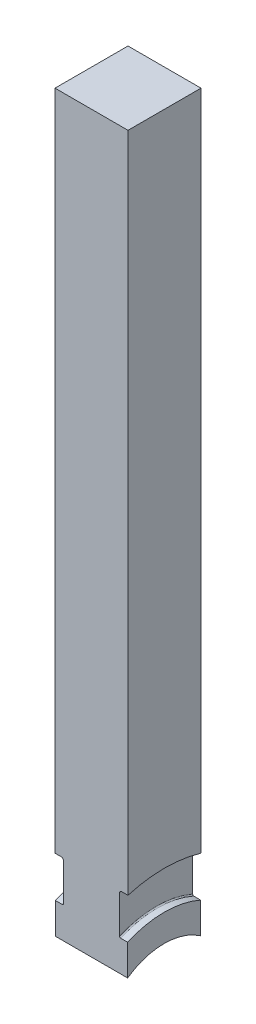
ISO-10303-21;
HEADER;
FILE_DESCRIPTION(('STEP AP214'),'2;1');
FILE_NAME('part.step','',(''),(''),'','','');
FILE_SCHEMA(('AUTOMOTIVE_DESIGN { 1 0 10303 214 1 1 1 1 }'));
ENDSEC;
DATA;
#1=APPLICATION_CONTEXT('core data for automotive mechanical design processes');
#2=APPLICATION_PROTOCOL_DEFINITION('international standard','automotive_design',2000,#1);
#3=PRODUCT_CONTEXT('',#1,'mechanical');
#4=PRODUCT('Part','Part','',(#3));
#5=PRODUCT_RELATED_PRODUCT_CATEGORY('part','',(#4));
#6=PRODUCT_DEFINITION_FORMATION('','',#4);
#7=PRODUCT_DEFINITION_CONTEXT('part definition',#1,'design');
#8=PRODUCT_DEFINITION('design','',#6,#7);
#9=PRODUCT_DEFINITION_SHAPE('','',#8);
#10=(LENGTH_UNIT() NAMED_UNIT(*) SI_UNIT(.MILLI.,.METRE.));
#11=(NAMED_UNIT(*) PLANE_ANGLE_UNIT() SI_UNIT($,.RADIAN.));
#12=(NAMED_UNIT(*) SI_UNIT($,.STERADIAN.) SOLID_ANGLE_UNIT());
#13=UNCERTAINTY_MEASURE_WITH_UNIT(LENGTH_MEASURE(1.E-05),#10,'distance_accuracy_value','');
#14=(GEOMETRIC_REPRESENTATION_CONTEXT(3) GLOBAL_UNCERTAINTY_ASSIGNED_CONTEXT((#13)) GLOBAL_UNIT_ASSIGNED_CONTEXT((#10,
#11,#12)) REPRESENTATION_CONTEXT('',''));
#15=CARTESIAN_POINT('',(0.,0.,0.));
#16=DIRECTION('',(0.,0.,1.));
#17=DIRECTION('',(1.,0.,0.));
#18=AXIS2_PLACEMENT_3D('',#15,#16,#17);
#19=CARTESIAN_POINT('',(12.827,276.225,12.827));
#20=DIRECTION('',(0.,0.,-1.));
#21=DIRECTION('',(0.,1.,0.));
#22=AXIS2_PLACEMENT_3D('',#19,#20,#21);
#23=PLANE('',#22);
#24=DIRECTION('',(-1.,0.,0.));
#25=VECTOR('',#24,1.);
#26=CARTESIAN_POINT('',(-8.84822894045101,29.043597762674,12.827));
#27=LINE('',#26,#25);
#28=CARTESIAN_POINT('',(-12.7,29.043597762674,12.827));
#29=VERTEX_POINT('',#28);
#30=CARTESIAN_POINT('',(-10.2362,29.043597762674,12.827));
#31=VERTEX_POINT('',#30);
#32=EDGE_CURVE('E196',#29,#31,#27,.F.);
#33=ORIENTED_EDGE('',*,*,#32,.F.);
#34=DIRECTION('',(0.,1.,0.));
#35=VECTOR('',#34,1.);
#36=CARTESIAN_POINT('',(-12.7,31.75,12.827));
#37=LINE('',#36,#35);
#38=CARTESIAN_POINT('',(-12.7,18.1498952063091,12.827));
#39=VERTEX_POINT('',#38);
#40=EDGE_CURVE('E178',#39,#29,#37,.T.);
#41=ORIENTED_EDGE('',*,*,#40,.F.);
#42=DIRECTION('',(1.,0.,0.));
#43=VECTOR('',#42,1.);
#44=CARTESIAN_POINT('',(-12.827,18.1498952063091,12.827));
#45=LINE('',#44,#43);
#46=CARTESIAN_POINT('',(12.7,18.1498952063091,12.827));
#47=VERTEX_POINT('',#46);
#48=EDGE_CURVE('E176',#39,#47,#45,.T.);
#49=ORIENTED_EDGE('',*,*,#48,.T.);
#50=DIRECTION('',(0.,-1.,0.));
#51=VECTOR('',#50,1.);
#52=CARTESIAN_POINT('',(12.7,31.75,12.827));
#53=LINE('',#52,#51);
#54=CARTESIAN_POINT('',(12.7,29.043597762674,12.827));
#55=VERTEX_POINT('',#54);
#56=EDGE_CURVE('E165',#55,#47,#53,.T.);
#57=ORIENTED_EDGE('',*,*,#56,.F.);
#58=DIRECTION('',(-1.,0.,0.));
#59=VECTOR('',#58,1.);
#60=CARTESIAN_POINT('',(-8.84822894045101,29.043597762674,12.827));
#61=LINE('',#60,#59);
#62=CARTESIAN_POINT('',(10.2362,29.043597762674,12.827));
#63=VERTEX_POINT('',#62);
#64=EDGE_CURVE('E152',#63,#55,#61,.F.);
#65=ORIENTED_EDGE('',*,*,#64,.F.);
#66=CARTESIAN_POINT('',(10.2362,29.043597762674,12.827));
#67=CARTESIAN_POINT('',(10.2160708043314,29.0435722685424,12.827));
#68=CARTESIAN_POINT('',(10.1959577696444,29.0453398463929,12.827));
#69=CARTESIAN_POINT('',(10.1563845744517,29.0522597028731,12.827));
#70=CARTESIAN_POINT('',(10.1369225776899,29.057401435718,12.827));
#71=CARTESIAN_POINT('',(10.0991468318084,29.0708679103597,12.827));
#72=CARTESIAN_POINT('',(10.0808326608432,29.0791914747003,12.827));
#73=CARTESIAN_POINT('',(10.0457902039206,29.0986936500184,12.827));
#74=CARTESIAN_POINT('',(10.0290627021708,29.1098736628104,12.827));
#75=CARTESIAN_POINT('',(9.99700861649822,29.1351379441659,12.827));
#76=CARTESIAN_POINT('',(9.98175149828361,29.1493101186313,12.827));
#77=CARTESIAN_POINT('',(9.95361671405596,29.1798419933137,12.827));
#78=CARTESIAN_POINT('',(9.9407396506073,29.1962022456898,12.827));
#79=CARTESIAN_POINT('',(9.91662869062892,29.2320467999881,12.827));
#80=CARTESIAN_POINT('',(9.90561137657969,29.2516766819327,12.827));
#81=CARTESIAN_POINT('',(9.8867485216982,29.2924113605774,12.827));
#82=CARTESIAN_POINT('',(9.87890468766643,29.3135169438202,12.827));
#83=CARTESIAN_POINT('',(9.86687995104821,29.3553145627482,12.827));
#84=CARTESIAN_POINT('',(9.86250087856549,29.375950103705,12.827));
#85=CARTESIAN_POINT('',(9.85666099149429,29.417597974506,12.827));
#86=CARTESIAN_POINT('',(9.85519567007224,29.4386096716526,12.827));
#87=CARTESIAN_POINT('',(9.8552,29.4596203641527,12.827));
#88=B_SPLINE_CURVE_WITH_KNOTS('',3,(#66,#67,#68,#69,#70,#71,#72,#73,#74,#75,#76,#77,#78,#79,#80,
#81,#82,#83,#84,#85,#86,#87),.UNSPECIFIED.,.F.,.F.,(4,2,2,2,2,2,2,2,2,2,4),(0.,
0.0602849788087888,0.120382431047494,0.180457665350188,0.240562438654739,0.302769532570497,
0.364992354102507,0.432238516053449,0.499520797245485,0.562601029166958,0.625583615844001),.UNSPECIFIED.);
#89=CARTESIAN_POINT('',(9.8552,29.4596203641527,12.827));
#90=VERTEX_POINT('',#89);
#91=EDGE_CURVE('E11',#63,#90,#88,.T.);
#92=ORIENTED_EDGE('',*,*,#91,.T.);
#93=DIRECTION('',(0.,-1.,0.));
#94=VECTOR('',#93,1.);
#95=CARTESIAN_POINT('',(9.8552,276.225,12.827));
#96=LINE('',#95,#94);
#97=CARTESIAN_POINT('',(9.8552,42.5855524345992,12.827));
#98=VERTEX_POINT('',#97);
#99=EDGE_CURVE('E211',#98,#90,#96,.T.);
#100=ORIENTED_EDGE('',*,*,#99,.F.);
#101=CARTESIAN_POINT('',(9.8552,42.5855524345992,12.827));
#102=CARTESIAN_POINT('',(9.85517024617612,42.6317662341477,12.827));
#103=CARTESIAN_POINT('',(9.85905310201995,42.6779817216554,12.827));
#104=CARTESIAN_POINT('',(9.87444611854,42.7691513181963,12.827));
#105=CARTESIAN_POINT('',(9.88596063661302,42.8141046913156,12.827));
#106=CARTESIAN_POINT('',(9.91643311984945,42.9014710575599,12.827));
#107=CARTESIAN_POINT('',(9.93539815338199,42.9438815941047,12.827));
#108=CARTESIAN_POINT('',(9.98032447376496,43.0247993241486,12.827));
#109=CARTESIAN_POINT('',(10.0062818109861,43.0633087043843,12.827));
#110=CARTESIAN_POINT('',(10.0639112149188,43.1343937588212,12.827));
#111=CARTESIAN_POINT('',(10.0954452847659,43.1670811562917,12.827));
#112=CARTESIAN_POINT('',(10.1637735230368,43.226428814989,12.827));
#113=CARTESIAN_POINT('',(10.200568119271,43.2530885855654,12.827));
#114=CARTESIAN_POINT('',(10.2767372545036,43.2984392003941,12.827));
#115=CARTESIAN_POINT('',(10.3159443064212,43.3174118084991,12.827));
#116=CARTESIAN_POINT('',(10.3970519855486,43.348201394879,12.827));
#117=CARTESIAN_POINT('',(10.438949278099,43.3600270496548,12.827));
#118=CARTESIAN_POINT('',(10.5038932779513,43.3722863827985,12.827));
#119=CARTESIAN_POINT('',(10.526453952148,43.3754629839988,12.827));
#120=CARTESIAN_POINT('',(10.571739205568,43.3796991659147,12.827));
#121=CARTESIAN_POINT('',(10.594463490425,43.3807618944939,12.827));
#122=CARTESIAN_POINT('',(10.6171999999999,43.3807610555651,12.827));
#123=B_SPLINE_CURVE_WITH_KNOTS('',3,(#101,#102,#103,#104,#105,#106,#107,#108,#109,#110,#111,
#112,#113,#114,#115,#116,#117,#118,#119,#120,#121,#122),.UNSPECIFIED.,.F.,.F.,(4,2,2,2,2,2,2,2,
2,2,4),(0.,0.138483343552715,0.277045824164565,0.415740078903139,0.554356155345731,
0.689928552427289,0.825511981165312,0.955539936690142,1.08540971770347,1.15367212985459,
1.22183281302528),.UNSPECIFIED.);
#124=CARTESIAN_POINT('',(10.6172,43.3807610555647,12.827));
#125=VERTEX_POINT('',#124);
#126=EDGE_CURVE('E295',#98,#125,#123,.T.);
#127=ORIENTED_EDGE('',*,*,#126,.T.);
#128=DIRECTION('',(-1.,0.,0.));
#129=VECTOR('',#128,1.);
#130=CARTESIAN_POINT('',(-8.84822894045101,43.3807610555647,12.827));
#131=LINE('',#130,#129);
#132=CARTESIAN_POINT('',(12.827,43.3807610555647,12.827));
#133=VERTEX_POINT('',#132);
#134=EDGE_CURVE('E206',#133,#125,#131,.T.);
#135=ORIENTED_EDGE('',*,*,#134,.F.);
#136=DIRECTION('',(0.,-1.,0.));
#137=VECTOR('',#136,1.);
#138=CARTESIAN_POINT('',(12.827,276.225,12.827));
#139=LINE('',#138,#137);
#140=CARTESIAN_POINT('',(12.827,276.225,12.827));
#141=VERTEX_POINT('',#140);
#142=EDGE_CURVE('E222',#141,#133,#139,.T.);
#143=ORIENTED_EDGE('',*,*,#142,.F.);
#144=DIRECTION('',(-1.,0.,0.));
#145=VECTOR('',#144,1.);
#146=CARTESIAN_POINT('',(12.827,276.225,12.827));
#147=LINE('',#146,#145);
#148=CARTESIAN_POINT('',(-12.827,276.225,12.827));
#149=VERTEX_POINT('',#148);
#150=EDGE_CURVE('E237',#141,#149,#147,.T.);
#151=ORIENTED_EDGE('',*,*,#150,.T.);
#152=DIRECTION('',(0.,-1.,0.));
#153=VECTOR('',#152,1.);
#154=CARTESIAN_POINT('',(-12.827,276.225,12.827));
#155=LINE('',#154,#153);
#156=CARTESIAN_POINT('',(-12.827,43.3807610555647,12.827));
#157=VERTEX_POINT('',#156);
#158=EDGE_CURVE('E231',#149,#157,#155,.T.);
#159=ORIENTED_EDGE('',*,*,#158,.T.);
#160=DIRECTION('',(-1.,0.,0.));
#161=VECTOR('',#160,1.);
#162=CARTESIAN_POINT('',(-8.84822894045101,43.3807610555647,12.827));
#163=LINE('',#162,#161);
#164=CARTESIAN_POINT('',(-10.6172,43.3807610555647,12.827));
#165=VERTEX_POINT('',#164);
#166=EDGE_CURVE('E202',#165,#157,#163,.T.);
#167=ORIENTED_EDGE('',*,*,#166,.F.);
#168=CARTESIAN_POINT('',(-10.6172,43.3807610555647,12.827));
#169=CARTESIAN_POINT('',(-10.5756065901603,43.3808045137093,12.827));
#170=CARTESIAN_POINT('',(-10.5340342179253,43.3772126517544,12.827));
#171=CARTESIAN_POINT('',(-10.4521637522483,43.363091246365,12.827));
#172=CARTESIAN_POINT('',(-10.411863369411,43.3525750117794,12.827));
#173=CARTESIAN_POINT('',(-10.3335975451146,43.3249343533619,12.827));
#174=CARTESIAN_POINT('',(-10.295632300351,43.3078093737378,12.827));
#175=CARTESIAN_POINT('',(-10.223045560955,43.2675367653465,12.827));
#176=CARTESIAN_POINT('',(-10.1884245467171,43.2443882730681,12.827));
#177=CARTESIAN_POINT('',(-10.1228284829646,43.1923475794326,12.827));
#178=CARTESIAN_POINT('',(-10.0919268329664,43.1633629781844,12.827));
#179=CARTESIAN_POINT('',(-10.0352031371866,43.1007883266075,12.827));
#180=CARTESIAN_POINT('',(-10.0093823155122,43.0671971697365,12.827));
#181=CARTESIAN_POINT('',(-9.96248271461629,42.9949745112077,12.827));
#182=CARTESIAN_POINT('',(-9.9416282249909,42.9561975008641,12.827));
#183=CARTESIAN_POINT('',(-9.90645002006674,42.8757858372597,12.827));
#184=CARTESIAN_POINT('',(-9.89212634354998,42.8341511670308,12.827));
#185=CARTESIAN_POINT('',(-9.87256356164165,42.7580053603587,12.827));
#186=CARTESIAN_POINT('',(-9.86605461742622,42.7238136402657,12.827));
#187=CARTESIAN_POINT('',(-9.85737265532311,42.6549344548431,12.827));
#188=CARTESIAN_POINT('',(-9.85519333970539,42.6202477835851,12.827));
#189=CARTESIAN_POINT('',(-9.85520000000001,42.5855524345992,12.827));
#190=B_SPLINE_CURVE_WITH_KNOTS('',3,(#168,#169,#170,#171,#172,#173,#174,#175,#176,#177,#178,
#179,#180,#181,#182,#183,#184,#185,#186,#187,#188,#189),.UNSPECIFIED.,.F.,.F.,(4,2,2,2,2,2,2,2,
2,2,4),(0.,0.124593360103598,0.248947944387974,0.373312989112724,0.497695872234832,
0.624229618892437,0.750793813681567,0.882295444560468,1.01379785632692,1.11794997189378,
1.22195048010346),.UNSPECIFIED.);
#191=CARTESIAN_POINT('',(-9.85520000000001,42.5855524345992,12.827));
#192=VERTEX_POINT('',#191);
#193=EDGE_CURVE('E264',#165,#192,#190,.T.);
#194=ORIENTED_EDGE('',*,*,#193,.T.);
#195=DIRECTION('',(0.,1.,0.));
#196=VECTOR('',#195,1.);
#197=CARTESIAN_POINT('',(-9.85520000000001,276.225,12.827));
#198=LINE('',#197,#196);
#199=CARTESIAN_POINT('',(-9.85520000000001,29.4596203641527,12.827));
#200=VERTEX_POINT('',#199);
#201=EDGE_CURVE('E160',#200,#192,#198,.T.);
#202=ORIENTED_EDGE('',*,*,#201,.F.);
#203=CARTESIAN_POINT('',(-9.85520000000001,29.4596203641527,12.827));
#204=CARTESIAN_POINT('',(-9.85518989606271,29.434572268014,12.827));
#205=CARTESIAN_POINT('',(-9.85727632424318,29.4095174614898,12.827));
#206=CARTESIAN_POINT('',(-9.86557747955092,29.3600490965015,12.827));
#207=CARTESIAN_POINT('',(-9.87180075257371,29.3356369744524,12.827));
#208=CARTESIAN_POINT('',(-9.8883214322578,29.2881862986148,12.827));
#209=CARTESIAN_POINT('',(-9.89862433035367,29.2651496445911,12.827));
#210=CARTESIAN_POINT('',(-9.92312499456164,29.2212642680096,12.827));
#211=CARTESIAN_POINT('',(-9.93731902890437,29.2004134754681,12.827));
#212=CARTESIAN_POINT('',(-9.96856972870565,29.1625759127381,12.827));
#213=CARTESIAN_POINT('',(-9.98546338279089,29.145454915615,12.827));
#214=CARTESIAN_POINT('',(-10.0221325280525,29.1146162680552,12.827));
#215=CARTESIAN_POINT('',(-10.0419075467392,29.1008980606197,12.827));
#216=CARTESIAN_POINT('',(-10.0819198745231,29.0785475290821,12.827));
#217=CARTESIAN_POINT('',(-10.1019691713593,29.0695778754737,12.827));
#218=CARTESIAN_POINT('',(-10.1433538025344,29.0554628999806,12.827));
#219=CARTESIAN_POINT('',(-10.1646864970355,29.0503099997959,12.827));
#220=CARTESIAN_POINT('',(-10.1945530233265,29.0459922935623,12.827));
#221=CARTESIAN_POINT('',(-10.2028633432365,29.0450944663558,12.827));
#222=CARTESIAN_POINT('',(-10.2195142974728,29.0438978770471,12.827));
#223=CARTESIAN_POINT('',(-10.2278548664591,29.0435982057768,12.827));
#224=CARTESIAN_POINT('',(-10.2362,29.043597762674,12.827));
#225=B_SPLINE_CURVE_WITH_KNOTS('',3,(#203,#204,#205,#206,#207,#208,#209,#210,#211,#212,#213,
#214,#215,#216,#217,#218,#219,#220,#221,#222,#223,#224),.UNSPECIFIED.,.F.,.F.,(4,2,2,2,2,2,2,2,
2,2,4),(0.,0.0750698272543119,0.150295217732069,0.225622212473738,0.300877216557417,
0.372647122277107,0.444405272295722,0.509955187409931,0.57537459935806,0.600433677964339,
0.625454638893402),.UNSPECIFIED.);
#226=EDGE_CURVE('E309',#200,#31,#225,.T.);
#227=ORIENTED_EDGE('',*,*,#226,.T.);
#228=EDGE_LOOP('',(#33,#41,#49,#57,#65,#92,#100,#127,#135,#143,#151,#159,#167,#194,#202,#227));
#229=FACE_BOUND('',#228,.T.);
#230=ADVANCED_FACE('F37',(#229),#23,.F.);
#231=CARTESIAN_POINT('',(12.827,276.225,-12.827));
#232=DIRECTION('',(0.,0.,1.));
#233=DIRECTION('',(0.,-1.,0.));
#234=AXIS2_PLACEMENT_3D('',#231,#232,#233);
#235=PLANE('',#234);
#236=DIRECTION('',(1.,0.,0.));
#237=VECTOR('',#236,1.);
#238=CARTESIAN_POINT('',(-12.827,18.149895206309,-12.827));
#239=LINE('',#238,#237);
#240=CARTESIAN_POINT('',(12.7,18.149895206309,-12.827));
#241=VERTEX_POINT('',#240);
#242=CARTESIAN_POINT('',(-12.7,18.149895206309,-12.827));
#243=VERTEX_POINT('',#242);
#244=EDGE_CURVE('E214',#241,#243,#239,.F.);
#245=ORIENTED_EDGE('',*,*,#244,.T.);
#246=DIRECTION('',(0.,1.,0.));
#247=VECTOR('',#246,1.);
#248=CARTESIAN_POINT('',(-12.7,31.75,-12.827));
#249=LINE('',#248,#247);
#250=CARTESIAN_POINT('',(-12.7,29.043597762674,-12.827));
#251=VERTEX_POINT('',#250);
#252=EDGE_CURVE('E181',#243,#251,#249,.T.);
#253=ORIENTED_EDGE('',*,*,#252,.T.);
#254=DIRECTION('',(-1.,0.,0.));
#255=VECTOR('',#254,1.);
#256=CARTESIAN_POINT('',(-8.84822894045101,29.043597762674,-12.827));
#257=LINE('',#256,#255);
#258=CARTESIAN_POINT('',(-10.2362,29.043597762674,-12.827));
#259=VERTEX_POINT('',#258);
#260=EDGE_CURVE('E193',#259,#251,#257,.T.);
#261=ORIENTED_EDGE('',*,*,#260,.F.);
#262=CARTESIAN_POINT('',(-10.2362,29.043597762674,-12.827));
#263=CARTESIAN_POINT('',(-10.2160708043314,29.0435722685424,-12.827));
#264=CARTESIAN_POINT('',(-10.1959577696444,29.0453398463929,-12.827));
#265=CARTESIAN_POINT('',(-10.1563845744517,29.0522597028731,-12.827));
#266=CARTESIAN_POINT('',(-10.1369225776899,29.0574014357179,-12.827));
#267=CARTESIAN_POINT('',(-10.0991468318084,29.0708679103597,-12.827));
#268=CARTESIAN_POINT('',(-10.0808326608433,29.0791914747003,-12.827));
#269=CARTESIAN_POINT('',(-10.0457902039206,29.0986936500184,-12.827));
#270=CARTESIAN_POINT('',(-10.0290627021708,29.1098736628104,-12.827));
#271=CARTESIAN_POINT('',(-9.99700861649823,29.1351379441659,-12.827));
#272=CARTESIAN_POINT('',(-9.98175149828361,29.1493101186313,-12.827));
#273=CARTESIAN_POINT('',(-9.95361671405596,29.1798419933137,-12.827));
#274=CARTESIAN_POINT('',(-9.94073965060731,29.1962022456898,-12.827));
#275=CARTESIAN_POINT('',(-9.91662869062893,29.2320467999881,-12.827));
#276=CARTESIAN_POINT('',(-9.9056113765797,29.2516766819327,-12.827));
#277=CARTESIAN_POINT('',(-9.88674852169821,29.2924113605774,-12.827));
#278=CARTESIAN_POINT('',(-9.87890468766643,29.3135169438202,-12.827));
#279=CARTESIAN_POINT('',(-9.86687995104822,29.3553145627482,-12.827));
#280=CARTESIAN_POINT('',(-9.86250087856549,29.375950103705,-12.827));
#281=CARTESIAN_POINT('',(-9.85666099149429,29.4175979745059,-12.827));
#282=CARTESIAN_POINT('',(-9.85519567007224,29.4386096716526,-12.827));
#283=CARTESIAN_POINT('',(-9.85520000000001,29.4596203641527,-12.827));
#284=B_SPLINE_CURVE_WITH_KNOTS('',3,(#262,#263,#264,#265,#266,#267,#268,#269,#270,#271,#272,
#273,#274,#275,#276,#277,#278,#279,#280,#281,#282,#283),.UNSPECIFIED.,.F.,.F.,(4,2,2,2,2,2,2,2,
2,2,4),(0.,0.0602849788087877,0.120382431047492,0.180457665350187,0.240562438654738,
0.302769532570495,0.364992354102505,0.432238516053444,0.49952079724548,0.562601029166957,
0.625583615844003),.UNSPECIFIED.);
#285=CARTESIAN_POINT('',(-9.85520000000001,29.4596203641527,-12.827));
#286=VERTEX_POINT('',#285);
#287=EDGE_CURVE('E315',#259,#286,#284,.T.);
#288=ORIENTED_EDGE('',*,*,#287,.T.);
#289=DIRECTION('',(0.,-1.,0.));
#290=VECTOR('',#289,1.);
#291=CARTESIAN_POINT('',(-9.85520000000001,276.225,-12.827));
#292=LINE('',#291,#290);
#293=CARTESIAN_POINT('',(-9.85520000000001,42.5855524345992,-12.827));
#294=VERTEX_POINT('',#293);
#295=EDGE_CURVE('E240',#294,#286,#292,.T.);
#296=ORIENTED_EDGE('',*,*,#295,.F.);
#297=CARTESIAN_POINT('',(-9.85520000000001,42.5855524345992,-12.827));
#298=CARTESIAN_POINT('',(-9.85517024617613,42.6317662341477,-12.827));
#299=CARTESIAN_POINT('',(-9.85905310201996,42.6779817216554,-12.827));
#300=CARTESIAN_POINT('',(-9.87444611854,42.7691513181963,-12.827));
#301=CARTESIAN_POINT('',(-9.88596063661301,42.8141046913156,-12.827));
#302=CARTESIAN_POINT('',(-9.91643311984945,42.9014710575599,-12.827));
#303=CARTESIAN_POINT('',(-9.935398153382,42.9438815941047,-12.827));
#304=CARTESIAN_POINT('',(-9.98032447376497,43.0247993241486,-12.827));
#305=CARTESIAN_POINT('',(-10.0062818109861,43.0633087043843,-12.827));
#306=CARTESIAN_POINT('',(-10.0639112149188,43.1343937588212,-12.827));
#307=CARTESIAN_POINT('',(-10.0954452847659,43.1670811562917,-12.827));
#308=CARTESIAN_POINT('',(-10.1637735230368,43.226428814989,-12.827));
#309=CARTESIAN_POINT('',(-10.200568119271,43.2530885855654,-12.827));
#310=CARTESIAN_POINT('',(-10.2767372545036,43.2984392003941,-12.827));
#311=CARTESIAN_POINT('',(-10.3159443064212,43.3174118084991,-12.827));
#312=CARTESIAN_POINT('',(-10.3970519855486,43.348201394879,-12.827));
#313=CARTESIAN_POINT('',(-10.438949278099,43.3600270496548,-12.827));
#314=CARTESIAN_POINT('',(-10.5038932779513,43.3722863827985,-12.827));
#315=CARTESIAN_POINT('',(-10.526453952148,43.3754629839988,-12.827));
#316=CARTESIAN_POINT('',(-10.571739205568,43.3796991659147,-12.827));
#317=CARTESIAN_POINT('',(-10.594463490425,43.3807618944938,-12.827));
#318=CARTESIAN_POINT('',(-10.6171999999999,43.3807610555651,-12.827));
#319=B_SPLINE_CURVE_WITH_KNOTS('',3,(#297,#298,#299,#300,#301,#302,#303,#304,#305,#306,#307,
#308,#309,#310,#311,#312,#313,#314,#315,#316,#317,#318),.UNSPECIFIED.,.F.,.F.,(4,2,2,2,2,2,2,2,
2,2,4),(0.,0.138483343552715,0.277045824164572,0.415740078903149,0.554356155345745,
0.689928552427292,0.825511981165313,0.955539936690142,1.08540971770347,1.1536721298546,
1.22183281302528),.UNSPECIFIED.);
#320=CARTESIAN_POINT('',(-10.6172,43.3807610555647,-12.827));
#321=VERTEX_POINT('',#320);
#322=EDGE_CURVE('E256',#294,#321,#319,.T.);
#323=ORIENTED_EDGE('',*,*,#322,.T.);
#324=DIRECTION('',(-1.,0.,0.));
#325=VECTOR('',#324,1.);
#326=CARTESIAN_POINT('',(-8.84822894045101,43.3807610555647,-12.827));
#327=LINE('',#326,#325);
#328=CARTESIAN_POINT('',(-12.827,43.3807610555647,-12.827));
#329=VERTEX_POINT('',#328);
#330=EDGE_CURVE('E199',#329,#321,#327,.F.);
#331=ORIENTED_EDGE('',*,*,#330,.F.);
#332=DIRECTION('',(0.,1.,0.));
#333=VECTOR('',#332,1.);
#334=CARTESIAN_POINT('',(-12.827,276.225,-12.827));
#335=LINE('',#334,#333);
#336=CARTESIAN_POINT('',(-12.827,276.225,-12.827));
#337=VERTEX_POINT('',#336);
#338=EDGE_CURVE('E223',#329,#337,#335,.T.);
#339=ORIENTED_EDGE('',*,*,#338,.T.);
#340=DIRECTION('',(-1.,0.,0.));
#341=VECTOR('',#340,1.);
#342=CARTESIAN_POINT('',(12.827,276.225,-12.827));
#343=LINE('',#342,#341);
#344=CARTESIAN_POINT('',(12.827,276.225,-12.827));
#345=VERTEX_POINT('',#344);
#346=EDGE_CURVE('E228',#345,#337,#343,.T.);
#347=ORIENTED_EDGE('',*,*,#346,.F.);
#348=DIRECTION('',(0.,1.,0.));
#349=VECTOR('',#348,1.);
#350=CARTESIAN_POINT('',(12.827,276.225,-12.827));
#351=LINE('',#350,#349);
#352=CARTESIAN_POINT('',(12.827,43.3807610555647,-12.827));
#353=VERTEX_POINT('',#352);
#354=EDGE_CURVE('E226',#353,#345,#351,.T.);
#355=ORIENTED_EDGE('',*,*,#354,.F.);
#356=DIRECTION('',(-1.,0.,0.));
#357=VECTOR('',#356,1.);
#358=CARTESIAN_POINT('',(-8.84822894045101,43.3807610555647,-12.827));
#359=LINE('',#358,#357);
#360=CARTESIAN_POINT('',(10.6172,43.3807610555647,-12.827));
#361=VERTEX_POINT('',#360);
#362=EDGE_CURVE('E204',#361,#353,#359,.F.);
#363=ORIENTED_EDGE('',*,*,#362,.F.);
#364=CARTESIAN_POINT('',(10.6172,43.3807610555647,-12.827));
#365=CARTESIAN_POINT('',(10.5756065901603,43.3808045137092,-12.827));
#366=CARTESIAN_POINT('',(10.5340342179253,43.3772126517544,-12.827));
#367=CARTESIAN_POINT('',(10.4521637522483,43.363091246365,-12.827));
#368=CARTESIAN_POINT('',(10.411863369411,43.3525750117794,-12.827));
#369=CARTESIAN_POINT('',(10.3335975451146,43.3249343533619,-12.827));
#370=CARTESIAN_POINT('',(10.295632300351,43.3078093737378,-12.827));
#371=CARTESIAN_POINT('',(10.223045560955,43.2675367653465,-12.827));
#372=CARTESIAN_POINT('',(10.1884245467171,43.2443882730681,-12.827));
#373=CARTESIAN_POINT('',(10.1228284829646,43.1923475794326,-12.827));
#374=CARTESIAN_POINT('',(10.0919268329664,43.1633629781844,-12.827));
#375=CARTESIAN_POINT('',(10.0352031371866,43.1007883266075,-12.827));
#376=CARTESIAN_POINT('',(10.0093823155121,43.0671971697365,-12.827));
#377=CARTESIAN_POINT('',(9.96248271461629,42.9949745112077,-12.827));
#378=CARTESIAN_POINT('',(9.9416282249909,42.9561975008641,-12.827));
#379=CARTESIAN_POINT('',(9.90645002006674,42.8757858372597,-12.827));
#380=CARTESIAN_POINT('',(9.89212634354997,42.8341511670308,-12.827));
#381=CARTESIAN_POINT('',(9.87256356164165,42.7580053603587,-12.827));
#382=CARTESIAN_POINT('',(9.86605461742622,42.7238136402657,-12.827));
#383=CARTESIAN_POINT('',(9.85737265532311,42.6549344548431,-12.827));
#384=CARTESIAN_POINT('',(9.85519333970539,42.6202477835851,-12.827));
#385=CARTESIAN_POINT('',(9.8552,42.5855524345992,-12.827));
#386=B_SPLINE_CURVE_WITH_KNOTS('',3,(#364,#365,#366,#367,#368,#369,#370,#371,#372,#373,#374,
#375,#376,#377,#378,#379,#380,#381,#382,#383,#384,#385),.UNSPECIFIED.,.F.,.F.,(4,2,2,2,2,2,2,2,
2,2,4),(0.,0.124593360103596,0.248947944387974,0.373312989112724,0.497695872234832,
0.624229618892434,0.750793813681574,0.882295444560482,1.01379785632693,1.11794997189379,
1.22195048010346),.UNSPECIFIED.);
#387=CARTESIAN_POINT('',(9.8552,42.5855524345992,-12.827));
#388=VERTEX_POINT('',#387);
#389=EDGE_CURVE('E289',#361,#388,#386,.T.);
#390=ORIENTED_EDGE('',*,*,#389,.T.);
#391=DIRECTION('',(0.,1.,0.));
#392=VECTOR('',#391,1.);
#393=CARTESIAN_POINT('',(9.8552,276.225,-12.827));
#394=LINE('',#393,#392);
#395=CARTESIAN_POINT('',(9.8552,29.4596203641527,-12.827));
#396=VERTEX_POINT('',#395);
#397=EDGE_CURVE('E170',#396,#388,#394,.T.);
#398=ORIENTED_EDGE('',*,*,#397,.F.);
#399=CARTESIAN_POINT('',(9.8552,29.4596203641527,-12.827));
#400=CARTESIAN_POINT('',(9.85518989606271,29.434572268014,-12.827));
#401=CARTESIAN_POINT('',(9.85727632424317,29.4095174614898,-12.827));
#402=CARTESIAN_POINT('',(9.86557747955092,29.3600490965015,-12.827));
#403=CARTESIAN_POINT('',(9.87180075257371,29.3356369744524,-12.827));
#404=CARTESIAN_POINT('',(9.8883214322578,29.2881862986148,-12.827));
#405=CARTESIAN_POINT('',(9.89862433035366,29.2651496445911,-12.827));
#406=CARTESIAN_POINT('',(9.92312499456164,29.2212642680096,-12.827));
#407=CARTESIAN_POINT('',(9.93731902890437,29.200413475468,-12.827));
#408=CARTESIAN_POINT('',(9.96856972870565,29.1625759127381,-12.827));
#409=CARTESIAN_POINT('',(9.98546338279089,29.145454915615,-12.827));
#410=CARTESIAN_POINT('',(10.0221325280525,29.1146162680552,-12.827));
#411=CARTESIAN_POINT('',(10.0419075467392,29.1008980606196,-12.827));
#412=CARTESIAN_POINT('',(10.081919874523,29.0785475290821,-12.827));
#413=CARTESIAN_POINT('',(10.1019691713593,29.0695778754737,-12.827));
#414=CARTESIAN_POINT('',(10.1433538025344,29.0554628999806,-12.827));
#415=CARTESIAN_POINT('',(10.1646864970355,29.0503099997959,-12.827));
#416=CARTESIAN_POINT('',(10.1945530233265,29.0459922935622,-12.827));
#417=CARTESIAN_POINT('',(10.2028633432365,29.0450944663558,-12.827));
#418=CARTESIAN_POINT('',(10.2195142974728,29.043897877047,-12.827));
#419=CARTESIAN_POINT('',(10.2278548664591,29.0435982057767,-12.827));
#420=CARTESIAN_POINT('',(10.2362,29.0435977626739,-12.827));
#421=B_SPLINE_CURVE_WITH_KNOTS('',3,(#399,#400,#401,#402,#403,#404,#405,#406,#407,#408,#409,
#410,#411,#412,#413,#414,#415,#416,#417,#418,#419,#420),.UNSPECIFIED.,.F.,.F.,(4,2,2,2,2,2,2,2,
2,2,4),(0.,0.0750698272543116,0.150295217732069,0.225622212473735,0.300877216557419,
0.372647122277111,0.444405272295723,0.509955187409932,0.575374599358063,0.600433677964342,
0.625454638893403),.UNSPECIFIED.);
#422=CARTESIAN_POINT('',(10.2362,29.043597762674,-12.827));
#423=VERTEX_POINT('',#422);
#424=EDGE_CURVE('E51',#396,#423,#421,.T.);
#425=ORIENTED_EDGE('',*,*,#424,.T.);
#426=DIRECTION('',(-1.,0.,0.));
#427=VECTOR('',#426,1.);
#428=CARTESIAN_POINT('',(-8.84822894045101,29.043597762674,-12.827));
#429=LINE('',#428,#427);
#430=CARTESIAN_POINT('',(12.7,29.043597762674,-12.827));
#431=VERTEX_POINT('',#430);
#432=EDGE_CURVE('E161',#431,#423,#429,.T.);
#433=ORIENTED_EDGE('',*,*,#432,.F.);
#434=DIRECTION('',(0.,-1.,0.));
#435=VECTOR('',#434,1.);
#436=CARTESIAN_POINT('',(12.7,31.75,-12.827));
#437=LINE('',#436,#435);
#438=EDGE_CURVE('E168',#431,#241,#437,.T.);
#439=ORIENTED_EDGE('',*,*,#438,.T.);
#440=EDGE_LOOP('',(#245,#253,#261,#288,#296,#323,#331,#339,#347,#355,#363,#390,#398,#425,#433,#439));
#441=FACE_BOUND('',#440,.T.);
#442=ADVANCED_FACE('F270',(#441),#235,.F.);
#443=CARTESIAN_POINT('',(-12.827,0.,0.));
#444=DIRECTION('',(-1.,0.,0.));
#445=DIRECTION('',(0.,0.,1.));
#446=AXIS2_PLACEMENT_3D('',#443,#444,#445);
#447=PLANE('',#446);
#448=ORIENTED_EDGE('',*,*,#338,.F.);
#449=CARTESIAN_POINT('',(-12.827,0.,0.));
#450=DIRECTION('',(-1.,0.,0.));
#451=DIRECTION('',(0.,0.,1.));
#452=AXIS2_PLACEMENT_3D('',#449,#450,#451);
#453=CIRCLE('',#452,45.2374);
#454=EDGE_CURVE('E189',#157,#329,#453,.T.);
#455=ORIENTED_EDGE('',*,*,#454,.F.);
#456=ORIENTED_EDGE('',*,*,#158,.F.);
#457=DIRECTION('',(0.,0.,1.));
#458=VECTOR('',#457,1.);
#459=CARTESIAN_POINT('',(-12.827,276.225,12.827));
#460=LINE('',#459,#458);
#461=EDGE_CURVE('E218',#337,#149,#460,.T.);
#462=ORIENTED_EDGE('',*,*,#461,.F.);
#463=EDGE_LOOP('',(#448,#455,#456,#462));
#464=FACE_BOUND('',#463,.T.);
#465=ADVANCED_FACE('F378',(#464),#447,.T.);
#466=CARTESIAN_POINT('',(12.827,276.225,12.827));
#467=DIRECTION('',(0.,-1.,0.));
#468=DIRECTION('',(0.,0.,-1.));
#469=AXIS2_PLACEMENT_3D('',#466,#467,#468);
#470=PLANE('',#469);
#471=ORIENTED_EDGE('',*,*,#461,.T.);
#472=ORIENTED_EDGE('',*,*,#150,.F.);
#473=DIRECTION('',(0.,0.,1.));
#474=VECTOR('',#473,1.);
#475=CARTESIAN_POINT('',(12.827,276.225,12.827));
#476=LINE('',#475,#474);
#477=EDGE_CURVE('E219',#345,#141,#476,.T.);
#478=ORIENTED_EDGE('',*,*,#477,.F.);
#479=ORIENTED_EDGE('',*,*,#346,.T.);
#480=EDGE_LOOP('',(#471,#472,#478,#479));
#481=FACE_BOUND('',#480,.T.);
#482=ADVANCED_FACE('F281',(#481),#470,.F.);
#483=CARTESIAN_POINT('',(12.827,0.,0.));
#484=DIRECTION('',(-1.,0.,0.));
#485=DIRECTION('',(0.,0.,1.));
#486=AXIS2_PLACEMENT_3D('',#483,#484,#485);
#487=PLANE('',#486);
#488=CARTESIAN_POINT('',(12.827,0.,0.));
#489=DIRECTION('',(-1.,0.,0.));
#490=DIRECTION('',(0.,0.,1.));
#491=AXIS2_PLACEMENT_3D('',#488,#489,#490);
#492=CIRCLE('',#491,45.2374);
#493=EDGE_CURVE('E190',#133,#353,#492,.T.);
#494=ORIENTED_EDGE('',*,*,#493,.T.);
#495=ORIENTED_EDGE('',*,*,#354,.T.);
#496=ORIENTED_EDGE('',*,*,#477,.T.);
#497=ORIENTED_EDGE('',*,*,#142,.T.);
#498=EDGE_LOOP('',(#494,#495,#496,#497));
#499=FACE_BOUND('',#498,.T.);
#500=ADVANCED_FACE('F366',(#499),#487,.F.);
#501=CARTESIAN_POINT('',(-12.827,0.,0.));
#502=DIRECTION('',(1.,0.,0.));
#503=DIRECTION('',(0.,0.,-1.));
#504=AXIS2_PLACEMENT_3D('',#501,#502,#503);
#505=CYLINDRICAL_SURFACE('',#504,22.225);
#506=ORIENTED_EDGE('',*,*,#48,.F.);
#507=CARTESIAN_POINT('',(-12.7,0.,0.));
#508=DIRECTION('',(1.,0.,0.));
#509=DIRECTION('',(0.,1.,0.));
#510=AXIS2_PLACEMENT_3D('',#507,#508,#509);
#511=CIRCLE('',#510,22.225);
#512=EDGE_CURVE('E186',#39,#243,#511,.F.);
#513=ORIENTED_EDGE('',*,*,#512,.T.);
#514=ORIENTED_EDGE('',*,*,#244,.F.);
#515=CARTESIAN_POINT('',(12.7,0.,0.));
#516=DIRECTION('',(-1.,0.,0.));
#517=DIRECTION('',(0.,-1.,0.));
#518=AXIS2_PLACEMENT_3D('',#515,#516,#517);
#519=CIRCLE('',#518,22.225);
#520=EDGE_CURVE('E184',#241,#47,#519,.F.);
#521=ORIENTED_EDGE('',*,*,#520,.T.);
#522=EDGE_LOOP('',(#506,#513,#514,#521));
#523=FACE_BOUND('',#522,.T.);
#524=ADVANCED_FACE('F385',(#523),#505,.F.);
#525=CARTESIAN_POINT('',(-9.85520000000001,31.75,0.));
#526=DIRECTION('',(-1.,0.,0.));
#527=DIRECTION('',(0.,0.,1.));
#528=AXIS2_PLACEMENT_3D('',#525,#526,#527);
#529=PLANE('',#528);
#530=ORIENTED_EDGE('',*,*,#295,.T.);
#531=CARTESIAN_POINT('',(-9.85520000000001,0.,0.));
#532=DIRECTION('',(-1.,0.,0.));
#533=DIRECTION('',(0.,0.,1.));
#534=AXIS2_PLACEMENT_3D('',#531,#532,#533);
#535=CIRCLE('',#534,32.131);
#536=EDGE_CURVE('E328',#286,#200,#535,.F.);
#537=ORIENTED_EDGE('',*,*,#536,.T.);
#538=ORIENTED_EDGE('',*,*,#201,.T.);
#539=CARTESIAN_POINT('',(-9.85520000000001,0.,0.));
#540=DIRECTION('',(-1.,0.,0.));
#541=DIRECTION('',(0.,0.,1.));
#542=AXIS2_PLACEMENT_3D('',#539,#540,#541);
#543=CIRCLE('',#542,44.4754);
#544=EDGE_CURVE('E246',#192,#294,#543,.T.);
#545=ORIENTED_EDGE('',*,*,#544,.T.);
#546=EDGE_LOOP('',(#530,#537,#538,#545));
#547=FACE_BOUND('',#546,.T.);
#548=ADVANCED_FACE('F383',(#547),#529,.T.);
#549=CARTESIAN_POINT('',(-8.84822894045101,0.,0.));
#550=DIRECTION('',(-1.,0.,0.));
#551=DIRECTION('',(0.,0.,1.));
#552=AXIS2_PLACEMENT_3D('',#549,#550,#551);
#553=CYLINDRICAL_SURFACE('',#552,45.2374);
#554=ORIENTED_EDGE('',*,*,#330,.T.);
#555=CARTESIAN_POINT('',(-10.6172,0.,0.));
#556=DIRECTION('',(-1.,0.,0.));
#557=DIRECTION('',(0.,0.,1.));
#558=AXIS2_PLACEMENT_3D('',#555,#556,#557);
#559=CIRCLE('',#558,45.2374);
#560=EDGE_CURVE('E249',#321,#165,#559,.F.);
#561=ORIENTED_EDGE('',*,*,#560,.T.);
#562=ORIENTED_EDGE('',*,*,#166,.T.);
#563=ORIENTED_EDGE('',*,*,#454,.T.);
#564=EDGE_LOOP('',(#554,#561,#562,#563));
#565=FACE_BOUND('',#564,.T.);
#566=ADVANCED_FACE('F380',(#565),#553,.F.);
#567=CARTESIAN_POINT('',(-8.84822894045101,0.,0.));
#568=DIRECTION('',(-1.,0.,0.));
#569=DIRECTION('',(0.,0.,1.));
#570=AXIS2_PLACEMENT_3D('',#567,#568,#569);
#571=CYLINDRICAL_SURFACE('',#570,31.75);
#572=ORIENTED_EDGE('',*,*,#32,.T.);
#573=CARTESIAN_POINT('',(-10.2362,0.,0.));
#574=DIRECTION('',(-1.,0.,0.));
#575=DIRECTION('',(0.,0.,1.));
#576=AXIS2_PLACEMENT_3D('',#573,#574,#575);
#577=CIRCLE('',#576,31.75);
#578=EDGE_CURVE('E301',#31,#259,#577,.T.);
#579=ORIENTED_EDGE('',*,*,#578,.T.);
#580=ORIENTED_EDGE('',*,*,#260,.T.);
#581=CARTESIAN_POINT('',(-12.7,0.,0.));
#582=DIRECTION('',(1.,0.,0.));
#583=DIRECTION('',(0.,1.,0.));
#584=AXIS2_PLACEMENT_3D('',#581,#582,#583);
#585=CIRCLE('',#584,31.75);
#586=EDGE_CURVE('E169',#29,#251,#585,.F.);
#587=ORIENTED_EDGE('',*,*,#586,.F.);
#588=EDGE_LOOP('',(#572,#579,#580,#587));
#589=FACE_BOUND('',#588,.T.);
#590=ADVANCED_FACE('F336',(#589),#571,.T.);
#591=CARTESIAN_POINT('',(9.8552,31.75,0.));
#592=DIRECTION('',(1.,0.,0.));
#593=DIRECTION('',(0.,0.,-1.));
#594=AXIS2_PLACEMENT_3D('',#591,#592,#593);
#595=PLANE('',#594);
#596=ORIENTED_EDGE('',*,*,#99,.T.);
#597=CARTESIAN_POINT('',(9.8552,0.,0.));
#598=DIRECTION('',(1.,0.,0.));
#599=DIRECTION('',(0.,0.,-1.));
#600=AXIS2_PLACEMENT_3D('',#597,#598,#599);
#601=CIRCLE('',#600,32.131);
#602=EDGE_CURVE('E326',#90,#396,#601,.F.);
#603=ORIENTED_EDGE('',*,*,#602,.T.);
#604=ORIENTED_EDGE('',*,*,#397,.T.);
#605=CARTESIAN_POINT('',(9.8552,0.,0.));
#606=DIRECTION('',(1.,0.,0.));
#607=DIRECTION('',(0.,0.,-1.));
#608=AXIS2_PLACEMENT_3D('',#605,#606,#607);
#609=CIRCLE('',#608,44.4754);
#610=EDGE_CURVE('E254',#388,#98,#609,.T.);
#611=ORIENTED_EDGE('',*,*,#610,.T.);
#612=EDGE_LOOP('',(#596,#603,#604,#611));
#613=FACE_BOUND('',#612,.T.);
#614=ADVANCED_FACE('F356',(#613),#595,.T.);
#615=CARTESIAN_POINT('',(-8.84822894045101,0.,0.));
#616=DIRECTION('',(-1.,0.,0.));
#617=DIRECTION('',(0.,0.,1.));
#618=AXIS2_PLACEMENT_3D('',#615,#616,#617);
#619=CYLINDRICAL_SURFACE('',#618,31.75);
#620=ORIENTED_EDGE('',*,*,#432,.T.);
#621=CARTESIAN_POINT('',(10.2362,0.,0.));
#622=DIRECTION('',(1.,0.,0.));
#623=DIRECTION('',(0.,0.,-1.));
#624=AXIS2_PLACEMENT_3D('',#621,#622,#623);
#625=CIRCLE('',#624,31.75);
#626=EDGE_CURVE('E58',#423,#63,#625,.T.);
#627=ORIENTED_EDGE('',*,*,#626,.T.);
#628=ORIENTED_EDGE('',*,*,#64,.T.);
#629=CARTESIAN_POINT('',(12.7,0.,0.));
#630=DIRECTION('',(-1.,0.,0.));
#631=DIRECTION('',(0.,-1.,0.));
#632=AXIS2_PLACEMENT_3D('',#629,#630,#631);
#633=CIRCLE('',#632,31.75);
#634=EDGE_CURVE('E155',#431,#55,#633,.F.);
#635=ORIENTED_EDGE('',*,*,#634,.F.);
#636=EDGE_LOOP('',(#620,#627,#628,#635));
#637=FACE_BOUND('',#636,.T.);
#638=ADVANCED_FACE('F154',(#637),#619,.T.);
#639=CARTESIAN_POINT('',(-8.84822894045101,0.,0.));
#640=DIRECTION('',(-1.,0.,0.));
#641=DIRECTION('',(0.,0.,1.));
#642=AXIS2_PLACEMENT_3D('',#639,#640,#641);
#643=CYLINDRICAL_SURFACE('',#642,45.2374);
#644=ORIENTED_EDGE('',*,*,#134,.T.);
#645=CARTESIAN_POINT('',(10.6172,0.,0.));
#646=DIRECTION('',(1.,0.,0.));
#647=DIRECTION('',(0.,0.,-1.));
#648=AXIS2_PLACEMENT_3D('',#645,#646,#647);
#649=CIRCLE('',#648,45.2374);
#650=EDGE_CURVE('E251',#125,#361,#649,.F.);
#651=ORIENTED_EDGE('',*,*,#650,.T.);
#652=ORIENTED_EDGE('',*,*,#362,.T.);
#653=ORIENTED_EDGE('',*,*,#493,.F.);
#654=EDGE_LOOP('',(#644,#651,#652,#653));
#655=FACE_BOUND('',#654,.T.);
#656=ADVANCED_FACE('F362',(#655),#643,.F.);
#657=CARTESIAN_POINT('',(12.7,31.75,-12.827));
#658=DIRECTION('',(-1.,0.,0.));
#659=DIRECTION('',(0.,-1.,0.));
#660=AXIS2_PLACEMENT_3D('',#657,#658,#659);
#661=PLANE('',#660);
#662=ORIENTED_EDGE('',*,*,#438,.F.);
#663=ORIENTED_EDGE('',*,*,#634,.T.);
#664=ORIENTED_EDGE('',*,*,#56,.T.);
#665=ORIENTED_EDGE('',*,*,#520,.F.);
#666=EDGE_LOOP('',(#662,#663,#664,#665));
#667=FACE_BOUND('',#666,.T.);
#668=ADVANCED_FACE('F164',(#667),#661,.F.);
#669=CARTESIAN_POINT('',(-12.7,31.75,-12.827));
#670=DIRECTION('',(1.,0.,0.));
#671=DIRECTION('',(0.,1.,0.));
#672=AXIS2_PLACEMENT_3D('',#669,#670,#671);
#673=PLANE('',#672);
#674=ORIENTED_EDGE('',*,*,#40,.T.);
#675=ORIENTED_EDGE('',*,*,#586,.T.);
#676=ORIENTED_EDGE('',*,*,#252,.F.);
#677=ORIENTED_EDGE('',*,*,#512,.F.);
#678=EDGE_LOOP('',(#674,#675,#676,#677));
#679=FACE_BOUND('',#678,.T.);
#680=ADVANCED_FACE('F279',(#679),#673,.F.);
#681=CARTESIAN_POINT('',(-10.6172,0.,0.));
#682=DIRECTION('',(-1.,0.,0.));
#683=DIRECTION('',(0.,0.,1.));
#684=AXIS2_PLACEMENT_3D('',#681,#682,#683);
#685=TOROIDAL_SURFACE('',#684,44.4754,0.762);
#686=ORIENTED_EDGE('',*,*,#193,.F.);
#687=ORIENTED_EDGE('',*,*,#560,.F.);
#688=ORIENTED_EDGE('',*,*,#322,.F.);
#689=ORIENTED_EDGE('',*,*,#544,.F.);
#690=EDGE_LOOP('',(#686,#687,#688,#689));
#691=FACE_BOUND('',#690,.T.);
#692=ADVANCED_FACE('F273',(#691),#685,.F.);
#693=CARTESIAN_POINT('',(10.6172,0.,0.));
#694=DIRECTION('',(1.,0.,0.));
#695=DIRECTION('',(0.,0.,-1.));
#696=AXIS2_PLACEMENT_3D('',#693,#694,#695);
#697=TOROIDAL_SURFACE('',#696,44.4754,0.762);
#698=ORIENTED_EDGE('',*,*,#126,.F.);
#699=ORIENTED_EDGE('',*,*,#610,.F.);
#700=ORIENTED_EDGE('',*,*,#389,.F.);
#701=ORIENTED_EDGE('',*,*,#650,.F.);
#702=EDGE_LOOP('',(#698,#699,#700,#701));
#703=FACE_BOUND('',#702,.T.);
#704=ADVANCED_FACE('F278',(#703),#697,.F.);
#705=CARTESIAN_POINT('',(-10.2362,0.,0.));
#706=DIRECTION('',(-1.,0.,0.));
#707=DIRECTION('',(0.,0.,1.));
#708=AXIS2_PLACEMENT_3D('',#705,#706,#707);
#709=TOROIDAL_SURFACE('',#708,32.131,0.381);
#710=ORIENTED_EDGE('',*,*,#226,.F.);
#711=ORIENTED_EDGE('',*,*,#536,.F.);
#712=ORIENTED_EDGE('',*,*,#287,.F.);
#713=ORIENTED_EDGE('',*,*,#578,.F.);
#714=EDGE_LOOP('',(#710,#711,#712,#713));
#715=FACE_BOUND('',#714,.T.);
#716=ADVANCED_FACE('F285',(#715),#709,.F.);
#717=CARTESIAN_POINT('',(10.2362,0.,0.));
#718=DIRECTION('',(1.,0.,0.));
#719=DIRECTION('',(0.,0.,-1.));
#720=AXIS2_PLACEMENT_3D('',#717,#718,#719);
#721=TOROIDAL_SURFACE('',#720,32.131,0.381);
#722=ORIENTED_EDGE('',*,*,#91,.F.);
#723=ORIENTED_EDGE('',*,*,#626,.F.);
#724=ORIENTED_EDGE('',*,*,#424,.F.);
#725=ORIENTED_EDGE('',*,*,#602,.F.);
#726=EDGE_LOOP('',(#722,#723,#724,#725));
#727=FACE_BOUND('',#726,.T.);
#728=ADVANCED_FACE('F39',(#727),#721,.F.);
#729=CLOSED_SHELL('',(#230,#442,#465,#482,#500,#524,#548,#566,#590,#614,#638,#656,#668,#680,
#692,#704,#716,#728));
#730=MANIFOLD_SOLID_BREP('B2',#729);
#731=ADVANCED_BREP_SHAPE_REPRESENTATION('',(#18,#730),#14);
#732=SHAPE_DEFINITION_REPRESENTATION(#9,#731);
ENDSEC;
END-ISO-10303-21;
